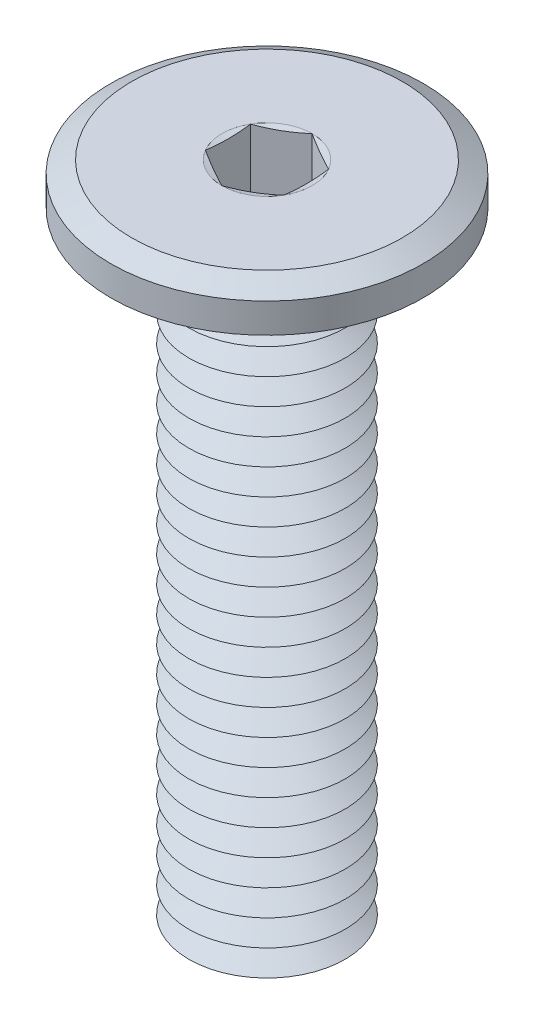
from build123d import *

# Parameters (mm, degrees)
SKETCH1_R           = 3
BOSS_EXTRUDE1_DEPTH = 0.8
SKETCH2_R           = 1.5
BOSS_EXTRUDE2_DEPTH = 12
LPATTERN1_COUNT     = 23
LPATTERN1_PITCH     = 0.5
FILLET1_R           = 0.1
CHAMFER2_SIZE       = 0.4
CHAMFER2_SIZE2      = 0.230940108
CUT_EXTRUDE1_DEPTH  = 1.4


with BuildPart() as part:
    # Sketch1 → Boss-Extrude1 (new body)
    with BuildSketch(Plane(origin=(0, 0, 0), x_dir=(1, 0, 0), z_dir=(0, 1, 0))):
        with Locations(Location((0, 0, 0), (0, 0, 270))):
            Circle(SKETCH1_R)
    extrude(amount=-BOSS_EXTRUDE1_DEPTH)

    # Sketch2 → Boss-Extrude2 (add)
    with BuildSketch(Plane.XZ.offset(0.8)):
        with Locations(Location((0, 0, 0), (0, 0, 270))):
            Circle(SKETCH2_R)
    extrude(amount=BOSS_EXTRUDE2_DEPTH)

    # Sketch5 → Cut-Revolve1 (revolve, cut)
    with BuildSketch(Plane(origin=(0, 0, 0), x_dir=(0, 0, -1), z_dir=(1, 0, 0))):
        Polygon((-1.5, -13.05), (-1.066987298, -12.8), (-1.5, -12.55), align=None)
    cut_revolve1 = revolve(axis=Axis((0, 0.990593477, 0), (0, -1, 0)), mode=Mode.SUBTRACT)

    # LPattern1: Cut-Revolve1 ×23
    with Locations(*[(0, i * LPATTERN1_PITCH, 0) for i in range(1, LPATTERN1_COUNT)]):
        add(cut_revolve1, mode=Mode.SUBTRACT)

    # Fillet1
    fillet1_edges = [part.edges().sort_by_distance(p)[0] for p in [
        (0, -0.8, 1.5),
    ]]
    fillet(fillet1_edges, radius=FILLET1_R)

    # Chamfer2
    chamfer2_edges = [part.edges().sort_by_distance(p)[0] for p in [
        (0, 0, -3),
    ]]
    chamfer2_side = [part.faces().sort_by_distance(p)[0] for p in [
        (0, 0, 0),
    ]]
    chamfer(chamfer2_edges, length=CHAMFER2_SIZE, length2=CHAMFER2_SIZE2, reference=chamfer2_side[0])

    # Sketch6 → Cut-Extrude1 (cut)
    with BuildSketch(Plane(origin=(0, 0, 0), x_dir=(1, 0, 0), z_dir=(0, 1, 0))):
        Polygon((0, 0.866025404), (-0.75, 0.433012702), (-0.75, -0.433012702), (0, -0.866025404), (0.75, -0.433012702), (0.75, 0.433012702), align=None)
    extrude(amount=-CUT_EXTRUDE1_DEPTH, mode=Mode.SUBTRACT)

    # Cut-Extrude2 cone 1 section (on through the dimple's axis) → Cut-Extrude2 (revolve, cut)
    with BuildSketch(Plane(origin=(0, -1.4, 0), x_dir=(0, 0, 1), z_dir=(1, 0, 0))):
        Polygon((0, 0), (0.75, 0), (0, 0.433012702), align=None)
    revolve(axis=Axis((0, -1.4, 0), (0, -1, 0)), mode=Mode.SUBTRACT)

    # Cut-Extrude3 cone 1 section (on through the dimple's axis) → Cut-Extrude3 (revolve, cut)
    with BuildSketch(Plane(origin=(0, 0, 0), x_dir=(0, 0, 1), z_dir=(1, 0, 0))):
        Polygon((0, 0), (0.866025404, 0), (0, 0.232050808), align=None)
    revolve(axis=Axis((0, 0, 0), (0, -1, 0)), mode=Mode.SUBTRACT)


solid = part.part
